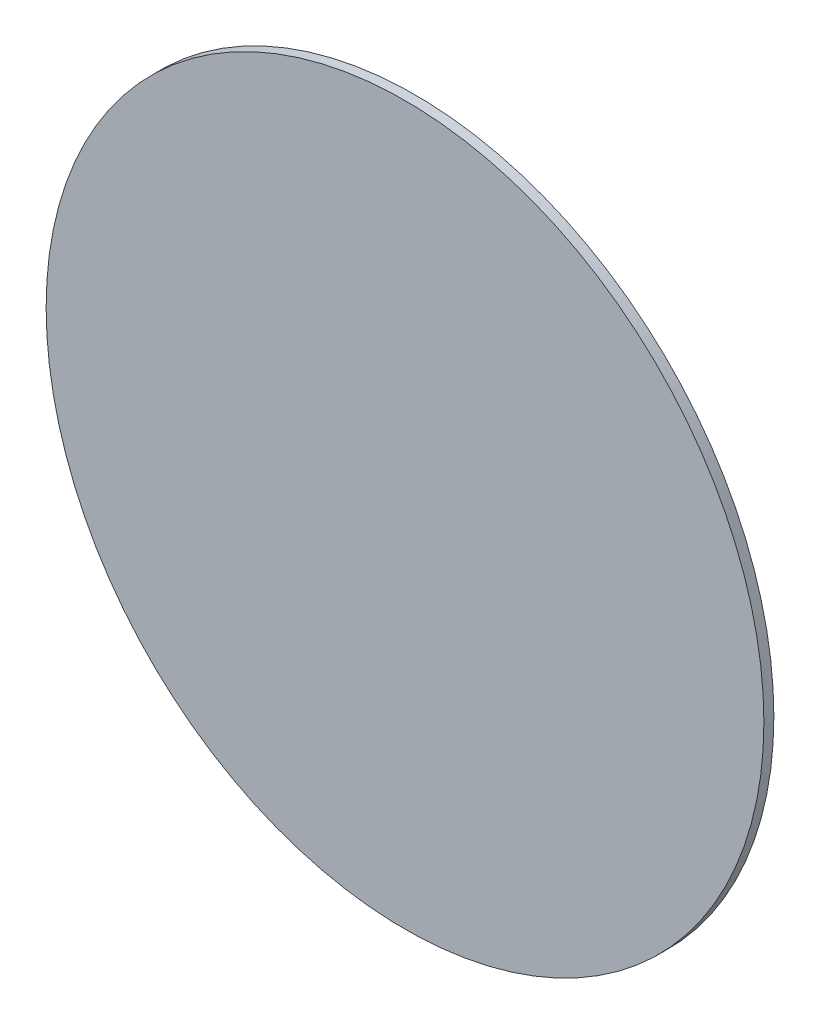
from build123d import *

# Parameters (mm, degrees)
SKETCH3_R           = 90
BOSS_EXTRUDE1_DEPTH = 2.5


with BuildPart() as part:
    # Sketch3 → Boss-Extrude1 (new body)
    with BuildSketch(Plane.XY):
        with Locations((0, 39.155307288)):
            Circle(SKETCH3_R)
    extrude(amount=BOSS_EXTRUDE1_DEPTH)


solid = part.part
